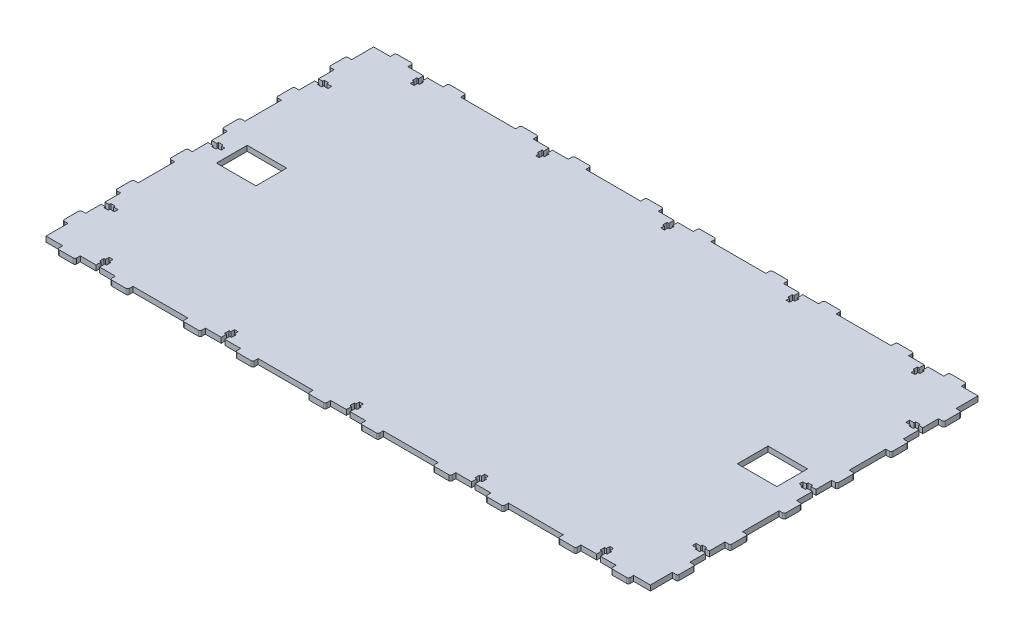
from build123d import *

# Parameters (mm, degrees)
EXTRUDE_1_DEPTH     = 6
SKETCH_2_W          = 45
SKETCH_2_H          = 35
CUT_EXTRUDE_1_DEPTH = 791.767348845


with BuildPart() as part:
    # Sketch 1 → Extrude 1 (new body)
    with BuildSketch(Plane(origin=(0, 0, 0), x_dir=(1, 0, 0), z_dir=(0, 1, 0))):
        with BuildLine():
            Line((0, 0), (19, 0))
            Line((19, 0), (19, -4))
            ThreePointArc((19, -4), (19.585786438, -5.414213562), (21, -6))
            Line((21, -6), (37, -6))
            ThreePointArc((37, -6), (38.414213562, -5.414213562), (39, -4))
            Line((39, -4), (39, 0))
            Line((39, 0), (56.9, 0))
            Line((56.9, 0), (56.9, 5.9))
            Line((56.9, 5.9), (55, 5.9))
            Line((55, 5.9), (55, 11))
            Line((55, 11), (56.9, 11))
            Line((56.9, 11), (56.9, 15))
            Line((56.9, 15), (61.1, 15))
            Line((61.1, 15), (61.1, 11))
            Line((61.1, 11), (63, 11))
            Line((63, 11), (63, 5.9))
            Line((63, 5.9), (61.1, 5.9))
            Line((61.1, 5.9), (61.1, 0))
            Line((61.1, 0), (79, 0))
            Line((79, 0), (79, -4))
            ThreePointArc((79, -4), (79.585786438, -5.414213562), (81, -6))
            Line((81, -6), (97, -6))
            ThreePointArc((97, -6), (98.414213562, -5.414213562), (99, -4))
            Line((99, -4), (99, 0))
            Line((99, 0), (161.5, 0))
            Line((161.5, 0), (161.5, -4))
            ThreePointArc((161.5, -4), (162.085786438, -5.414213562), (163.5, -6))
            Line((163.5, -6), (179.5, -6))
            ThreePointArc((179.5, -6), (180.914213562, -5.414213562), (181.5, -4))
            Line((181.5, -4), (181.5, 0))
            Line((181.5, 0), (199.5, 0))
            Line((199.5, 0), (199.5, 5.9))
            Line((199.5, 5.9), (197.5, 5.9))
            Line((197.5, 5.9), (197.5, 11))
            Line((197.5, 11), (199.5, 11))
            Line((199.5, 11), (199.5, 15))
            Line((199.5, 15), (203.5, 15))
            Line((203.5, 15), (203.5, 11))
            Line((203.5, 11), (205.5, 11))
            Line((205.5, 11), (205.5, 5.9))
            Line((205.5, 5.9), (203.5, 5.9))
            Line((203.5, 5.9), (203.5, 0))
            Line((203.5, 0), (221.5, 0))
            Line((221.5, 0), (221.5, -4))
            ThreePointArc((221.5, -4), (222.085786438, -5.414213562), (223.5, -6))
            Line((223.5, -6), (239.5, -6))
            ThreePointArc((239.5, -6), (240.914213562, -5.414213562), (241.5, -4))
            Line((241.5, -4), (241.5, 0))
            Line((241.5, 0), (304, 0))
            Line((304, 0), (304, -4))
            ThreePointArc((304, -4), (304.585786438, -5.414213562), (306, -6))
            Line((306, -6), (322, -6))
            ThreePointArc((322, -6), (323.414213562, -5.414213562), (324, -4))
            Line((324, -4), (324, 0))
            Line((324, 0), (341.9, 0))
            Line((341.9, 0), (341.9, 5.9))
            Line((341.9, 5.9), (340, 5.9))
            Line((340, 5.9), (340, 11))
            Line((340, 11), (341.9, 11))
            Line((341.9, 11), (341.9, 15))
            Line((341.9, 15), (346.1, 15))
            Line((346.1, 15), (346.1, 11))
            Line((346.1, 11), (348, 11))
            Line((348, 11), (348, 5.9))
            Line((348, 5.9), (346.1, 5.9))
            Line((346.1, 5.9), (346.1, 0))
            Line((346.1, 0), (364, 0))
            Line((364, 0), (364, -4))
            ThreePointArc((364, -4), (364.585786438, -5.414213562), (366, -6))
            Line((366, -6), (382, -6))
            ThreePointArc((382, -6), (383.414213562, -5.414213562), (384, -4))
            Line((384, -4), (384, 0))
            Line((384, 0), (446.5, 0))
            Line((446.5, 0), (446.5, -4))
            ThreePointArc((446.5, -4), (447.085786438, -5.414213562), (448.5, -6))
            Line((448.5, -6), (464.5, -6))
            ThreePointArc((464.5, -6), (465.914213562, -5.414213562), (466.5, -4))
            Line((466.5, -4), (466.5, 0))
            Line((466.5, 0), (484.5, 0))
            Line((484.5, 0), (484.5, 5.9))
            Line((484.5, 5.9), (482.5, 5.9))
            Line((482.5, 5.9), (482.5, 11))
            Line((482.5, 11), (484.5, 11))
            Line((484.5, 11), (484.5, 15))
            Line((484.5, 15), (488.5, 15))
            Line((488.5, 15), (488.5, 11))
            Line((488.5, 11), (490.5, 11))
            Line((490.5, 11), (490.5, 5.9))
            Line((490.5, 5.9), (488.5, 5.9))
            Line((488.5, 5.9), (488.5, 0))
            Line((488.5, 0), (506.5, 0))
            Line((506.5, 0), (506.5, -4))
            ThreePointArc((506.5, -4), (507.085786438, -5.414213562), (508.5, -6))
            Line((508.5, -6), (524.5, -6))
            ThreePointArc((524.5, -6), (525.914213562, -5.414213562), (526.5, -4))
            Line((526.5, -4), (526.5, 0))
            Line((526.5, 0), (589, 0))
            Line((589, 0), (589, -4))
            ThreePointArc((589, -4), (589.585786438, -5.414213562), (591, -6))
            Line((591, -6), (607, -6))
            ThreePointArc((607, -6), (608.414213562, -5.414213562), (609, -4))
            Line((609, -4), (609, 0))
            Line((609, 0), (626.9, 0))
            Line((626.9, 0), (626.9, 5.9))
            Line((626.9, 5.9), (625, 5.9))
            Line((625, 5.9), (625, 11))
            Line((625, 11), (626.9, 11))
            Line((626.9, 11), (626.9, 15))
            Line((626.9, 15), (631.1, 15))
            Line((631.1, 15), (631.1, 11))
            Line((631.1, 11), (633, 11))
            Line((633, 11), (633, 5.9))
            Line((633, 5.9), (631.1, 5.9))
            Line((631.1, 5.9), (631.1, 0))
            Line((631.1, 0), (649, 0))
            Line((649, 0), (649, -4))
            ThreePointArc((649, -4), (649.585786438, -5.414213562), (651, -6))
            Line((651, -6), (667, -6))
            ThreePointArc((667, -6), (668.414213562, -5.414213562), (669, -4))
            Line((669, -4), (669, 0))
            Line((669, 0), (688, 0))
            Line((688, 0), (688, 25))
            Line((688, 25), (692, 25))
            ThreePointArc((692, 25), (693.414213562, 25.585786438), (694, 27))
            Line((694, 27), (694, 43))
            ThreePointArc((694, 43), (693.414213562, 44.414213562), (692, 45))
            Line((692, 45), (688, 45))
            Line((688, 45), (688, 62.9))
            Line((688, 62.9), (683.2, 62.9))
            Line((683.2, 62.9), (683.2, 61))
            Line((683.2, 61), (678.1, 61))
            Line((678.1, 61), (678.1, 62.9))
            Line((678.1, 62.9), (673, 62.9))
            Line((673, 62.9), (673, 67.1))
            Line((673, 67.1), (678.1, 67.1))
            Line((678.1, 67.1), (678.1, 69))
            Line((678.1, 69), (683.2, 69))
            Line((683.2, 69), (683.2, 67.1))
            Line((683.2, 67.1), (688, 67.1))
            Line((688, 67.1), (688, 85))
            Line((688, 85), (692, 85))
            ThreePointArc((692, 85), (693.414213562, 85.585786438), (694, 87))
            Line((694, 87), (694, 103))
            ThreePointArc((694, 103), (693.414213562, 104.414213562), (692, 105))
            Line((692, 105), (688, 105))
            Line((688, 105), (688, 146.5))
            Line((688, 146.5), (692, 146.5))
            ThreePointArc((692, 146.5), (693.414213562, 147.085786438), (694, 148.5))
            Line((694, 148.5), (694, 164.5))
            ThreePointArc((694, 164.5), (693.414213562, 165.914213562), (692, 166.5))
            Line((692, 166.5), (688, 166.5))
            Line((688, 166.5), (688, 184.4))
            Line((688, 184.4), (682.1, 184.4))
            Line((682.1, 184.4), (682.1, 182.5))
            Line((682.1, 182.5), (677, 182.5))
            Line((677, 182.5), (677, 184.4))
            Line((677, 184.4), (673, 184.4))
            Line((673, 184.4), (673, 188.6))
            Line((673, 188.6), (677, 188.6))
            Line((677, 188.6), (677, 190.5))
            Line((677, 190.5), (682.1, 190.5))
            Line((682.1, 190.5), (682.1, 188.6))
            Line((682.1, 188.6), (688, 188.6))
            Line((688, 188.6), (688, 206.5))
            Line((688, 206.5), (692, 206.5))
            ThreePointArc((692, 206.5), (693.414213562, 207.085786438), (694, 208.5))
            Line((694, 208.5), (694, 224.5))
            ThreePointArc((694, 224.5), (693.414213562, 225.914213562), (692, 226.5))
            Line((692, 226.5), (688, 226.5))
            Line((688, 226.5), (688, 268))
            Line((688, 268), (692, 268))
            ThreePointArc((692, 268), (693.414213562, 268.585786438), (694, 270))
            Line((694, 270), (694, 286))
            ThreePointArc((694, 286), (693.414213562, 287.414213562), (692, 288))
            Line((692, 288), (688, 288))
            Line((688, 288), (688, 305.9))
            Line((688, 305.9), (683.2, 305.9))
            Line((683.2, 305.9), (683.2, 304))
            Line((683.2, 304), (678.1, 304))
            Line((678.1, 304), (678.1, 305.9))
            Line((678.1, 305.9), (673, 305.9))
            Line((673, 305.9), (673, 310.1))
            Line((673, 310.1), (678.1, 310.1))
            Line((678.1, 310.1), (678.1, 312))
            Line((678.1, 312), (683.2, 312))
            Line((683.2, 312), (683.2, 310.1))
            Line((683.2, 310.1), (688, 310.1))
            Line((688, 310.1), (688, 328))
            Line((688, 328), (692, 328))
            ThreePointArc((692, 328), (693.414213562, 328.585786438), (694, 330))
            Line((694, 330), (694, 346))
            ThreePointArc((694, 346), (693.414213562, 347.414213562), (692, 348))
            Line((692, 348), (688, 348))
            Line((688, 348), (688, 373))
            Line((688, 373), (669, 373))
            Line((669, 373), (669, 377))
            ThreePointArc((669, 377), (668.414213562, 378.414213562), (667, 379))
            Line((667, 379), (651, 379))
            ThreePointArc((651, 379), (649.585786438, 378.414213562), (649, 377))
            Line((649, 377), (649, 373))
            Line((649, 373), (631.1, 373))
            Line((631.1, 373), (631.1, 367.1))
            Line((631.1, 367.1), (633, 367.1))
            Line((633, 367.1), (633, 362))
            Line((633, 362), (631.1, 362))
            Line((631.1, 362), (631.1, 358))
            Line((631.1, 358), (626.9, 358))
            Line((626.9, 358), (626.9, 362))
            Line((626.9, 362), (625, 362))
            Line((625, 362), (625, 367.1))
            Line((625, 367.1), (626.9, 367.1))
            Line((626.9, 367.1), (626.9, 373))
            Line((626.9, 373), (609, 373))
            Line((609, 373), (609, 377))
            ThreePointArc((609, 377), (608.414213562, 378.414213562), (607, 379))
            Line((607, 379), (591, 379))
            ThreePointArc((591, 379), (589.585786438, 378.414213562), (589, 377))
            Line((589, 377), (589, 373))
            Line((589, 373), (526.5, 373))
            Line((526.5, 373), (526.5, 377))
            ThreePointArc((526.5, 377), (525.914213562, 378.414213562), (524.5, 379))
            Line((524.5, 379), (508.5, 379))
            ThreePointArc((508.5, 379), (507.085786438, 378.414213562), (506.5, 377))
            Line((506.5, 377), (506.5, 373))
            Line((506.5, 373), (488.5, 373))
            Line((488.5, 373), (488.5, 367.1))
            Line((488.5, 367.1), (490.5, 367.1))
            Line((490.5, 367.1), (490.5, 362))
            Line((490.5, 362), (488.5, 362))
            Line((488.5, 362), (488.5, 358))
            Line((488.5, 358), (484.5, 358))
            Line((484.5, 358), (484.5, 362))
            Line((484.5, 362), (482.5, 362))
            Line((482.5, 362), (482.5, 367.1))
            Line((482.5, 367.1), (484.5, 367.1))
            Line((484.5, 367.1), (484.5, 373))
            Line((484.5, 373), (466.5, 373))
            Line((466.5, 373), (466.5, 377))
            ThreePointArc((466.5, 377), (465.914213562, 378.414213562), (464.5, 379))
            Line((464.5, 379), (448.5, 379))
            ThreePointArc((448.5, 379), (447.085786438, 378.414213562), (446.5, 377))
            Line((446.5, 377), (446.5, 373))
            Line((446.5, 373), (384, 373))
            Line((384, 373), (384, 377))
            ThreePointArc((384, 377), (383.414213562, 378.414213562), (382, 379))
            Line((382, 379), (366, 379))
            ThreePointArc((366, 379), (364.585786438, 378.414213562), (364, 377))
            Line((364, 377), (364, 373))
            Line((364, 373), (346.1, 373))
            Line((346.1, 373), (346.1, 367.1))
            Line((346.1, 367.1), (348, 367.1))
            Line((348, 367.1), (348, 362))
            Line((348, 362), (346.1, 362))
            Line((346.1, 362), (346.1, 358))
            Line((346.1, 358), (341.9, 358))
            Line((341.9, 358), (341.9, 362))
            Line((341.9, 362), (340, 362))
            Line((340, 362), (340, 367.1))
            Line((340, 367.1), (341.9, 367.1))
            Line((341.9, 367.1), (341.9, 373))
            Line((341.9, 373), (324, 373))
            Line((324, 373), (324, 377))
            ThreePointArc((324, 377), (323.414213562, 378.414213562), (322, 379))
            Line((322, 379), (306, 379))
            ThreePointArc((306, 379), (304.585786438, 378.414213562), (304, 377))
            Line((304, 377), (304, 373))
            Line((304, 373), (241.5, 373))
            Line((241.5, 373), (241.5, 377))
            ThreePointArc((241.5, 377), (240.914213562, 378.414213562), (239.5, 379))
            Line((239.5, 379), (223.5, 379))
            ThreePointArc((223.5, 379), (222.085786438, 378.414213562), (221.5, 377))
            Line((221.5, 377), (221.5, 373))
            Line((221.5, 373), (203.5, 373))
            Line((203.5, 373), (203.5, 367.1))
            Line((203.5, 367.1), (205.5, 367.1))
            Line((205.5, 367.1), (205.5, 362))
            Line((205.5, 362), (203.5, 362))
            Line((203.5, 362), (203.5, 358))
            Line((203.5, 358), (199.5, 358))
            Line((199.5, 358), (199.5, 362))
            Line((199.5, 362), (197.5, 362))
            Line((197.5, 362), (197.5, 367.1))
            Line((197.5, 367.1), (199.5, 367.1))
            Line((199.5, 367.1), (199.5, 373))
            Line((199.5, 373), (181.5, 373))
            Line((181.5, 373), (181.5, 377))
            ThreePointArc((181.5, 377), (180.914213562, 378.414213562), (179.5, 379))
            Line((179.5, 379), (163.5, 379))
            ThreePointArc((163.5, 379), (162.085786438, 378.414213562), (161.5, 377))
            Line((161.5, 377), (161.5, 373))
            Line((161.5, 373), (99, 373))
            Line((99, 373), (99, 377))
            ThreePointArc((99, 377), (98.414213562, 378.414213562), (97, 379))
            Line((97, 379), (81, 379))
            ThreePointArc((81, 379), (79.585786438, 378.414213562), (79, 377))
            Line((79, 377), (79, 373))
            Line((79, 373), (61.1, 373))
            Line((61.1, 373), (61.1, 367.1))
            Line((61.1, 367.1), (63, 367.1))
            Line((63, 367.1), (63, 362))
            Line((63, 362), (61.1, 362))
            Line((61.1, 362), (61.1, 358))
            Line((61.1, 358), (56.9, 358))
            Line((56.9, 358), (56.9, 362))
            Line((56.9, 362), (55, 362))
            Line((55, 362), (55, 367.1))
            Line((55, 367.1), (56.9, 367.1))
            Line((56.9, 367.1), (56.9, 373))
            Line((56.9, 373), (39, 373))
            Line((39, 373), (39, 377))
            ThreePointArc((39, 377), (38.414213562, 378.414213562), (37, 379))
            Line((37, 379), (21, 379))
            ThreePointArc((21, 379), (19.585786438, 378.414213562), (19, 377))
            Line((19, 377), (19, 373))
            Line((19, 373), (0, 373))
            Line((0, 373), (0, 348))
            Line((0, 348), (-4, 348))
            ThreePointArc((-4, 348), (-5.414213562, 347.414213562), (-6, 346))
            Line((-6, 346), (-6, 330))
            ThreePointArc((-6, 330), (-5.414213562, 328.585786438), (-4, 328))
            Line((-4, 328), (0, 328))
            Line((0, 328), (0, 310.1))
            Line((0, 310.1), (4.8, 310.1))
            Line((4.8, 310.1), (4.8, 312))
            Line((4.8, 312), (9.9, 312))
            Line((9.9, 312), (9.9, 310.1))
            Line((9.9, 310.1), (15, 310.1))
            Line((15, 310.1), (15, 305.9))
            Line((15, 305.9), (9.9, 305.9))
            Line((9.9, 305.9), (9.9, 304))
            Line((9.9, 304), (4.8, 304))
            Line((4.8, 304), (4.8, 305.9))
            Line((4.8, 305.9), (0, 305.9))
            Line((0, 305.9), (0, 288))
            Line((0, 288), (-4, 288))
            ThreePointArc((-4, 288), (-5.414213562, 287.414213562), (-6, 286))
            Line((-6, 286), (-6, 270))
            ThreePointArc((-6, 270), (-5.414213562, 268.585786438), (-4, 268))
            Line((-4, 268), (0, 268))
            Line((0, 268), (0, 226.5))
            Line((0, 226.5), (-4, 226.5))
            ThreePointArc((-4, 226.5), (-5.414213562, 225.914213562), (-6, 224.5))
            Line((-6, 224.5), (-6, 208.5))
            ThreePointArc((-6, 208.5), (-5.414213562, 207.085786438), (-4, 206.5))
            Line((-4, 206.5), (0, 206.5))
            Line((0, 206.5), (0, 188.6))
            Line((0, 188.6), (5.9, 188.6))
            Line((5.9, 188.6), (5.9, 190.5))
            Line((5.9, 190.5), (11, 190.5))
            Line((11, 190.5), (11, 188.6))
            Line((11, 188.6), (15, 188.6))
            Line((15, 188.6), (15, 184.4))
            Line((15, 184.4), (11, 184.4))
            Line((11, 184.4), (11, 182.5))
            Line((11, 182.5), (5.9, 182.5))
            Line((5.9, 182.5), (5.9, 184.4))
            Line((5.9, 184.4), (0, 184.4))
            Line((0, 184.4), (0, 166.5))
            Line((0, 166.5), (-4, 166.5))
            ThreePointArc((-4, 166.5), (-5.414213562, 165.914213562), (-6, 164.5))
            Line((-6, 164.5), (-6, 148.5))
            ThreePointArc((-6, 148.5), (-5.414213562, 147.085786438), (-4, 146.5))
            Line((-4, 146.5), (0, 146.5))
            Line((0, 146.5), (0, 105))
            Line((0, 105), (-4, 105))
            ThreePointArc((-4, 105), (-5.414213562, 104.414213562), (-6, 103))
            Line((-6, 103), (-6, 87))
            ThreePointArc((-6, 87), (-5.414213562, 85.585786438), (-4, 85))
            Line((-4, 85), (0, 85))
            Line((0, 85), (0, 67.1))
            Line((0, 67.1), (4.8, 67.1))
            Line((4.8, 67.1), (4.8, 69))
            Line((4.8, 69), (9.9, 69))
            Line((9.9, 69), (9.9, 67.1))
            Line((9.9, 67.1), (15, 67.1))
            Line((15, 67.1), (15, 62.9))
            Line((15, 62.9), (9.9, 62.9))
            Line((9.9, 62.9), (9.9, 61))
            Line((9.9, 61), (4.8, 61))
            Line((4.8, 61), (4.8, 62.9))
            Line((4.8, 62.9), (0, 62.9))
            Line((0, 62.9), (0, 45))
            Line((0, 45), (-4, 45))
            ThreePointArc((-4, 45), (-5.414213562, 44.414213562), (-6, 43))
            Line((-6, 43), (-6, 27))
            ThreePointArc((-6, 27), (-5.414213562, 25.585786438), (-4, 25))
            Line((-4, 25), (0, 25))
            Line((0, 25), (0, 0))
        make_face()
    extrude(amount=EXTRUDE_1_DEPTH)

    # Sketch 2 → Cut-Extrude 1 (cut, through all)
    with BuildSketch(Plane(origin=(0, 6, 0), x_dir=(1, 0, 0), z_dir=(0, 1, 0))):
        with Locations((47.5, 186.5)):
            Rectangle(SKETCH_2_W, SKETCH_2_H)
        with Locations((640.5, 186.5)):
            Rectangle(SKETCH_2_W, SKETCH_2_H)
    extrude(amount=-CUT_EXTRUDE_1_DEPTH, mode=Mode.SUBTRACT)


solid = part.part
